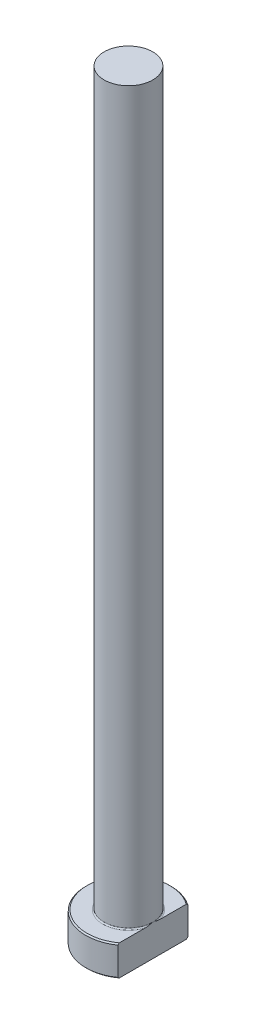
from build123d import *
from build123d.topology import SkipClean

# Parameters (mm, degrees)
CHAMFER1_SIZE = 0.2
FILLET1_R     = 0.2
KEY_DEPTH     = 126.391387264


with BuildPart() as part:
    # Sketch1 → Revolve1 (revolve)
    with BuildSketch(Plane.XY, mode=Mode.PRIVATE) as revolve1_sk:
        Polygon((0, 0), (-7, 0), (-7, 5), (-4, 5), (-4, 125), (0, 125), align=None)
    revolve(revolve1_sk.sketch.rotate(Axis((0, 259.958771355, 0), (0, -1, 0)), 270), axis=Axis((0, 259.958771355, 0), (0, -1, 0)))

    # Chamfer1
    chamfer1_edges = [part.edges().sort_by_distance(p)[0] for p in [
        (0, 5, -7),
        (0, 0, -7),
    ]]
    chamfer(chamfer1_edges, length=CHAMFER1_SIZE)

    # Fillet1
    fillet1_edges = [part.edges().sort_by_distance(p)[0] for p in [
        (0, 5, -4),
    ]]
    fillet(fillet1_edges, radius=FILLET1_R)

    # Sketch2 → KEY (cut, through all)
    with SkipClean():  # the faces are left unmerged after this step: merging them gives an invalid solid
        with BuildSketch(Plane(origin=(0, 0, 0), x_dir=(1, 0, 0), z_dir=(0, 1, 0))):
            with BuildLine():
                Line((4, 5.744562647), (4, -5.744562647))
                ThreePointArc((4, -5.744562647), (7, 0), (4, 5.744562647))
            make_face()
        extrude(amount=KEY_DEPTH, mode=Mode.SUBTRACT)


solid = part.part
